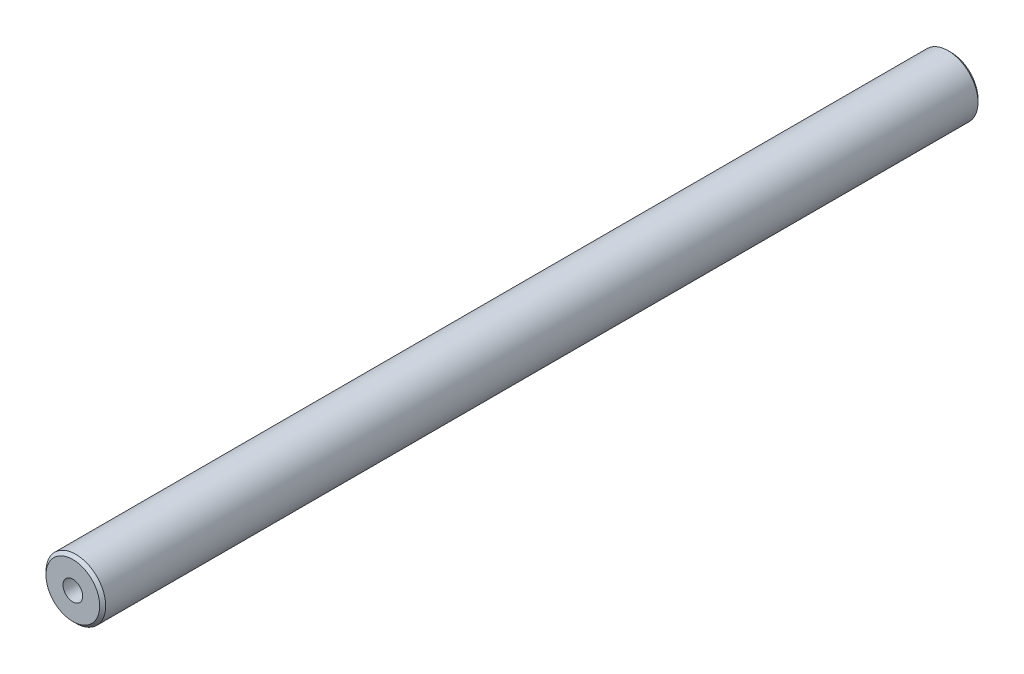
from build123d import *

# Parameters (mm, degrees)
ESQUISSE1_R      = 5
EXTRUSION1_DEPTH = 73.5
CHANFREIN1_SIZE  = 0.5


with BuildPart() as part:
    # Esquisse1 → Extrusion1 (new, symmetric)
    with BuildSketch(Plane.XY):
        Circle(ESQUISSE1_R)
    extrude(amount=EXTRUSION1_DEPTH, both=True)

    # Esquisse3 → Trou taraud_ M4x0.71 (revolve, cut)
    with BuildSketch(Plane(origin=(0, 0, 73.5), x_dir=(0, -1, 0), z_dir=(1, 0, 0))):
        Polygon((0, 0), (0, 11.091420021), (1.65, 10.1), (1.65, 0), align=None)
    trou_taraud_m4x0_71 = revolve(axis=Axis((0, 0, 79.85), (0, 0, -1)), mode=Mode.SUBTRACT)

    # Sym_trie1: Trou taraud_ M4x0.71 across plane
    add(trou_taraud_m4x0_71.mirror(Plane.XY), mode=Mode.SUBTRACT)

    # Chanfrein1
    chanfrein1_edges = [part.edges().sort_by_distance(p)[0] for p in [
        (-5, 0, -73.5),
        (-5, 0, 73.5),
    ]]
    chamfer(chanfrein1_edges, length=CHANFREIN1_SIZE)


solid = part.part
